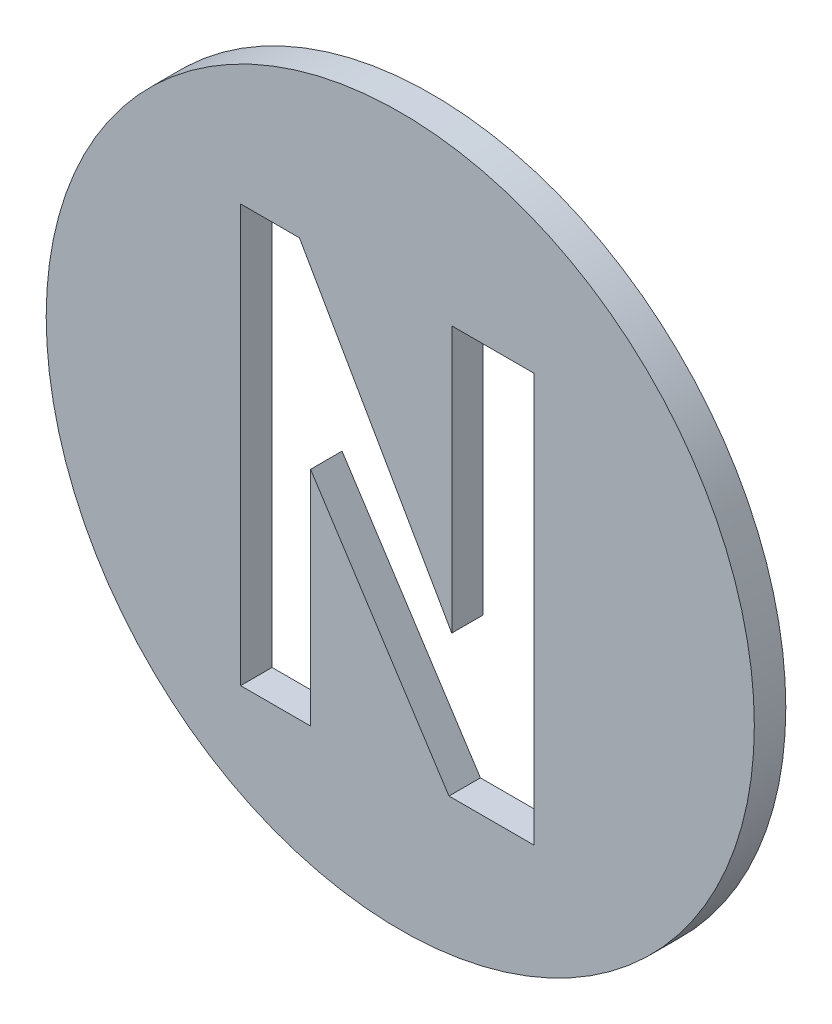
from build123d import *

# Parameters (mm, degrees)
SKETCH1_R           = 45
BOSS_EXTRUDE1_DEPTH = 4
CUT_EXTRUDE1_DEPTH  = 4


with BuildPart() as part:
    # Sketch1 → Boss-Extrude1 (new body)
    with BuildSketch(Plane.XY):
        Circle(SKETCH1_R)
    extrude(amount=BOSS_EXTRUDE1_DEPTH)

    # Sketch2 → Cut-Extrude1 (cut)
    with BuildSketch(Plane.XY.offset(4)):
        Polygon((-20.29380466, 24.767170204), (-12.812805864, 24.767170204), (6.5463886, -9.058235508), (6.5463886, 24.767170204), (17.02061036, 24.767170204), (17.02061036, -27.16751269), (6.188442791, -27.16751269), (-11.399235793, 0), (-11.399235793, -28.258577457), (-20.29380466, -28.258577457), align=None)
    extrude(amount=-CUT_EXTRUDE1_DEPTH, mode=Mode.SUBTRACT)


solid = part.part
